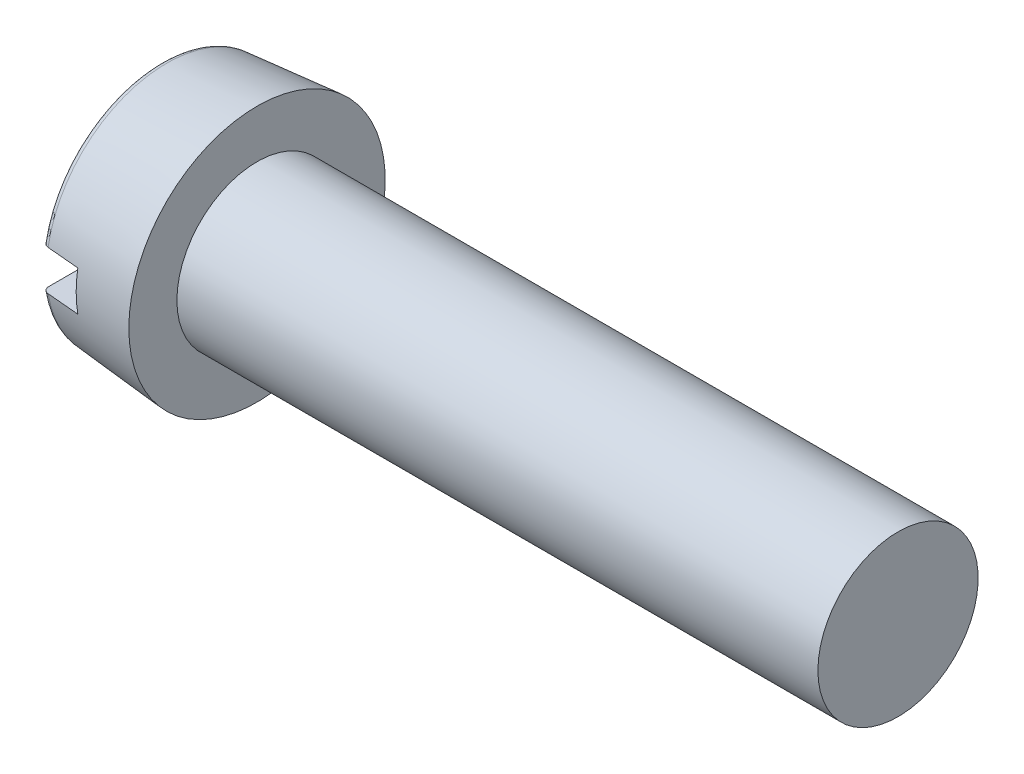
from build123d import *

# Parameters (mm, degrees)
FILLET1_R  = 0.4
SLOTSKE_W  = 16
SLOTSKE_H  = 2.5
SLOT_DEPTH = 2.4


with BuildPart() as part:
    # BodySke → BaseBody (revolve)
    with BuildSketch(Plane.XY, mode=Mode.PRIVATE) as basebody_sk:
        Polygon((0, 0), (0, 7.475068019), (6, 8), (6, 5), (46, 5), (46, 0), align=None)
    revolve(basebody_sk.sketch.rotate(Axis((0, 0, 0), (1, 0, 0)), 90), axis=Axis((0, 0, 0), (1, 0, 0)))

    # Fillet1
    fillet1_edges = [part.edges().sort_by_distance(p)[0] for p in [
        (0, 0, -7.475068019),
    ]]
    fillet(fillet1_edges, radius=FILLET1_R)

    # SlotSke → Slot (cut)
    with BuildSketch(Plane.ZY):
        Rectangle(SLOTSKE_W, SLOTSKE_H)
    extrude(amount=-SLOT_DEPTH, mode=Mode.SUBTRACT)


solid = part.part
